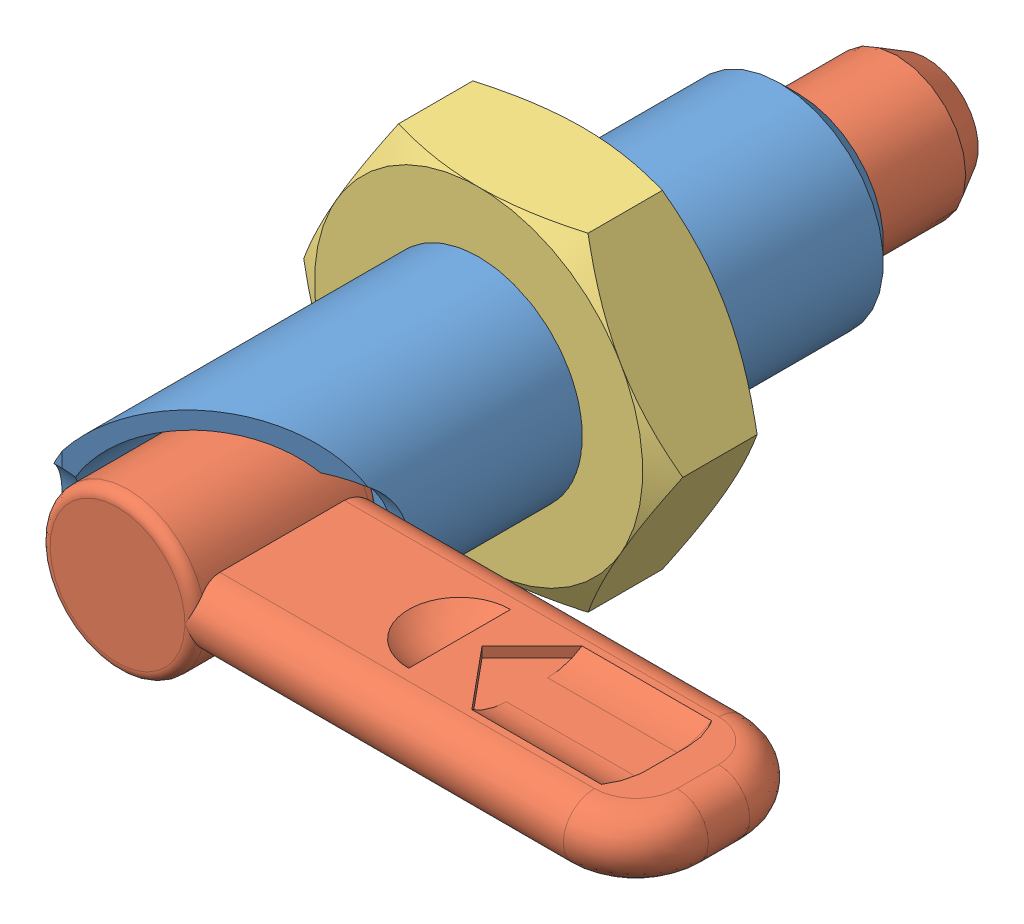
SolidWorks assembly GDX12LW-8N-SUS.sldasm, configuration Default (file format 15000). Lengths in mm.
Overall size (42.98 25.96 47.41).
3 component instances, 3 part files, 0 mates.
Components (placement in the parent):
- GDX12LW-8N-SUS_01-1: GDX12LW-8N-SUS_01.SLDPRT [ﾃﾞﾌｫﾙﾄ] x (1 0 0) z (0 -1 0) size (12.02 39.35 12.01)
- GDX12LW-8N-SUS_02-1: GDX12LW-8N-SUS_02.SLDPRT [ﾃﾞﾌｫﾙﾄ] x (1 0 0) z (0 -1 0) size (34.5 47.41 9)
- GDX12LW-8N-SUS_03-1: GDX12LW-8N-SUS_03.SLDPRT [ﾃﾞﾌｫﾙﾄ] at (0 0 12.5) x (0 0 1) z (0 1 0) size (6.01 25.96 25.96)
